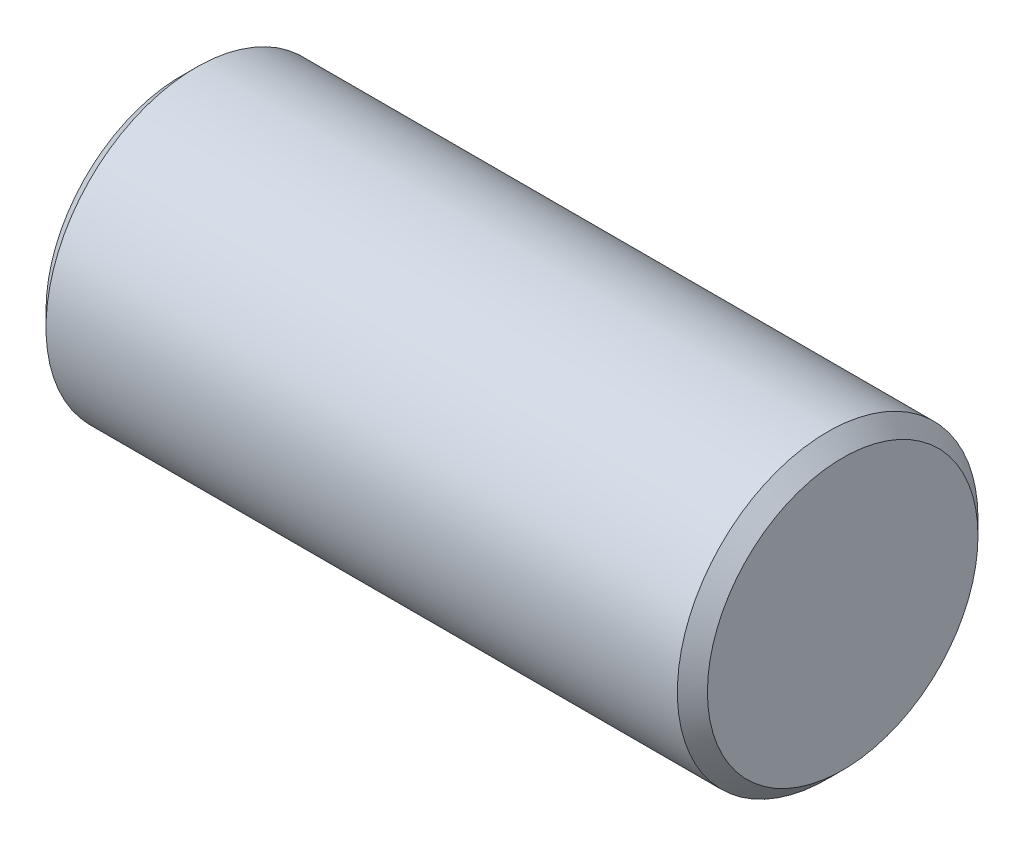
ISO-10303-21;
HEADER;
FILE_DESCRIPTION(('STEP AP214'),'2;1');
FILE_NAME('part.step','',(''),(''),'','','');
FILE_SCHEMA(('AUTOMOTIVE_DESIGN { 1 0 10303 214 1 1 1 1 }'));
ENDSEC;
DATA;
#1=APPLICATION_CONTEXT('core data for automotive mechanical design processes');
#2=APPLICATION_PROTOCOL_DEFINITION('international standard','automotive_design',2000,#1);
#3=PRODUCT_CONTEXT('',#1,'mechanical');
#4=PRODUCT('Part','Part','',(#3));
#5=PRODUCT_RELATED_PRODUCT_CATEGORY('part','',(#4));
#6=PRODUCT_DEFINITION_FORMATION('','',#4);
#7=PRODUCT_DEFINITION_CONTEXT('part definition',#1,'design');
#8=PRODUCT_DEFINITION('design','',#6,#7);
#9=PRODUCT_DEFINITION_SHAPE('','',#8);
#10=(LENGTH_UNIT() NAMED_UNIT(*) SI_UNIT(.MILLI.,.METRE.));
#11=(NAMED_UNIT(*) PLANE_ANGLE_UNIT() SI_UNIT($,.RADIAN.));
#12=(NAMED_UNIT(*) SI_UNIT($,.STERADIAN.) SOLID_ANGLE_UNIT());
#13=UNCERTAINTY_MEASURE_WITH_UNIT(LENGTH_MEASURE(1.E-05),#10,'distance_accuracy_value','');
#14=(GEOMETRIC_REPRESENTATION_CONTEXT(3) GLOBAL_UNCERTAINTY_ASSIGNED_CONTEXT((#13)) GLOBAL_UNIT_ASSIGNED_CONTEXT((#10,
#11,#12)) REPRESENTATION_CONTEXT('',''));
#15=CARTESIAN_POINT('',(0.,0.,0.));
#16=DIRECTION('',(0.,0.,1.));
#17=DIRECTION('',(1.,0.,0.));
#18=AXIS2_PLACEMENT_3D('',#15,#16,#17);
#19=CARTESIAN_POINT('',(-11.,0.,0.));
#20=DIRECTION('',(1.,0.,0.));
#21=DIRECTION('',(0.,0.,-1.));
#22=AXIS2_PLACEMENT_3D('',#19,#20,#21);
#23=PLANE('',#22);
#24=CARTESIAN_POINT('',(-11.,0.,0.));
#25=DIRECTION('',(1.,0.,0.));
#26=DIRECTION('',(0.,0.,-1.));
#27=AXIS2_PLACEMENT_3D('',#24,#25,#26);
#28=CIRCLE('',#27,4.5000014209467);
#29=CARTESIAN_POINT('',(-11.,0.,-4.5000014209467));
#30=VERTEX_POINT('',#29);
#31=EDGE_CURVE('E18',#30,#30,#28,.T.);
#32=ORIENTED_EDGE('',*,*,#31,.F.);
#33=EDGE_LOOP('',(#32));
#34=FACE_BOUND('',#33,.T.);
#35=ADVANCED_FACE('F14',(#34),#23,.F.);
#36=CARTESIAN_POINT('',(11.,0.,0.));
#37=DIRECTION('',(1.,0.,0.));
#38=DIRECTION('',(0.,0.,-1.));
#39=AXIS2_PLACEMENT_3D('',#36,#37,#38);
#40=PLANE('',#39);
#41=CARTESIAN_POINT('',(11.,0.,0.));
#42=DIRECTION('',(1.,0.,0.));
#43=DIRECTION('',(0.,0.,-1.));
#44=AXIS2_PLACEMENT_3D('',#41,#42,#43);
#45=CIRCLE('',#44,4.5000014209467);
#46=CARTESIAN_POINT('',(11.,0.,-4.5000014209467));
#47=VERTEX_POINT('',#46);
#48=EDGE_CURVE('E27',#47,#47,#45,.F.);
#49=ORIENTED_EDGE('',*,*,#48,.F.);
#50=EDGE_LOOP('',(#49));
#51=FACE_BOUND('',#50,.T.);
#52=ADVANCED_FACE('F38',(#51),#40,.T.);
#53=CARTESIAN_POINT('',(-10.5000002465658,0.,0.));
#54=DIRECTION('',(1.,0.,0.));
#55=DIRECTION('',(0.,0.,-1.));
#56=AXIS2_PLACEMENT_3D('',#53,#54,#55);
#57=CONICAL_SURFACE('',#56,5.00000133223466,0.785398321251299);
#58=CARTESIAN_POINT('',(-10.49999891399,0.,0.));
#59=DIRECTION('',(1.,0.,0.));
#60=DIRECTION('',(0.,0.,-1.));
#61=AXIS2_PLACEMENT_3D('',#58,#59,#60);
#62=CIRCLE('',#61,5.);
#63=CARTESIAN_POINT('',(-10.49999891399,0.,-5.));
#64=VERTEX_POINT('',#63);
#65=EDGE_CURVE('E22',#64,#64,#62,.T.);
#66=ORIENTED_EDGE('',*,*,#65,.F.);
#67=EDGE_LOOP('',(#66));
#68=FACE_BOUND('',#67,.T.);
#69=ORIENTED_EDGE('',*,*,#31,.T.);
#70=EDGE_LOOP('',(#69));
#71=FACE_BOUND('',#70,.T.);
#72=ADVANCED_FACE('F35',(#68,#71),#57,.T.);
#73=CARTESIAN_POINT('',(10.5000002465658,0.,0.));
#74=DIRECTION('',(-1.,0.,0.));
#75=DIRECTION('',(0.,0.,1.));
#76=AXIS2_PLACEMENT_3D('',#73,#74,#75);
#77=CONICAL_SURFACE('',#76,5.00000133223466,0.785398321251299);
#78=CARTESIAN_POINT('',(10.49999891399,0.,0.));
#79=DIRECTION('',(1.,0.,0.));
#80=DIRECTION('',(0.,0.,-1.));
#81=AXIS2_PLACEMENT_3D('',#78,#79,#80);
#82=CIRCLE('',#81,5.);
#83=CARTESIAN_POINT('',(10.49999891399,0.,-5.));
#84=VERTEX_POINT('',#83);
#85=EDGE_CURVE('E10',#84,#84,#82,.F.);
#86=ORIENTED_EDGE('',*,*,#85,.F.);
#87=EDGE_LOOP('',(#86));
#88=FACE_BOUND('',#87,.T.);
#89=ORIENTED_EDGE('',*,*,#48,.T.);
#90=EDGE_LOOP('',(#89));
#91=FACE_BOUND('',#90,.T.);
#92=ADVANCED_FACE('F47',(#88,#91),#77,.T.);
#93=CARTESIAN_POINT('',(-11.,0.,0.));
#94=DIRECTION('',(1.,0.,0.));
#95=DIRECTION('',(0.,0.,-1.));
#96=AXIS2_PLACEMENT_3D('',#93,#94,#95);
#97=CYLINDRICAL_SURFACE('',#96,5.);
#98=ORIENTED_EDGE('',*,*,#65,.T.);
#99=EDGE_LOOP('',(#98));
#100=FACE_BOUND('',#99,.T.);
#101=ORIENTED_EDGE('',*,*,#85,.T.);
#102=EDGE_LOOP('',(#101));
#103=FACE_BOUND('',#102,.T.);
#104=ADVANCED_FACE('F16',(#100,#103),#97,.T.);
#105=CLOSED_SHELL('',(#35,#52,#72,#92,#104));
#106=MANIFOLD_SOLID_BREP('B1',#105);
#107=ADVANCED_BREP_SHAPE_REPRESENTATION('',(#18,#106),#14);
#108=SHAPE_DEFINITION_REPRESENTATION(#9,#107);
ENDSEC;
END-ISO-10303-21;
